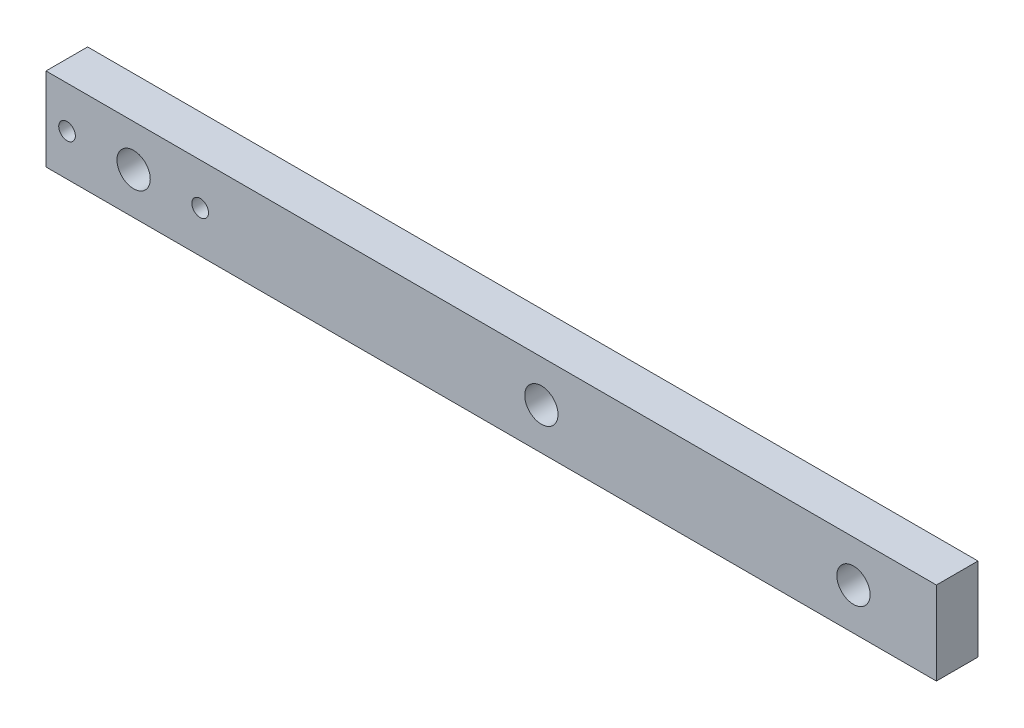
from build123d import *

# Parameters (mm, degrees)
SKETCH1_W           = 107
SKETCH1_H           = 10
BOSS_EXTRUDE1_DEPTH = 5
SKETCH2_R           = 2
SKETCH2_R_2         = 1
CUT_EXTRUDE1_DEPTH  = 5


with BuildPart() as part:
    # Sketch1 → Boss-Extrude1 (new body)
    with BuildSketch(Plane.XY):
        with Locations((-1.5, 0)):
            Rectangle(SKETCH1_W, SKETCH1_H)
    extrude(amount=BOSS_EXTRUDE1_DEPTH)

    # Sketch2 → Cut-Extrude1 (cut)
    with BuildSketch(Plane.XY.offset(5)):
        with Locations((-44.4705135, 0)):
            Circle(SKETCH2_R)
        with Locations((-52.4705135, 0)):
            Circle(SKETCH2_R_2)
        with Locations((-36.4705135, 0)):
            Circle(SKETCH2_R_2)
        with Locations((42.035938, 0)):
            Circle(SKETCH2_R)
        with Locations((4.5294865, 0)):
            Circle(SKETCH2_R)
    extrude(amount=-CUT_EXTRUDE1_DEPTH, mode=Mode.SUBTRACT)


solid = part.part
